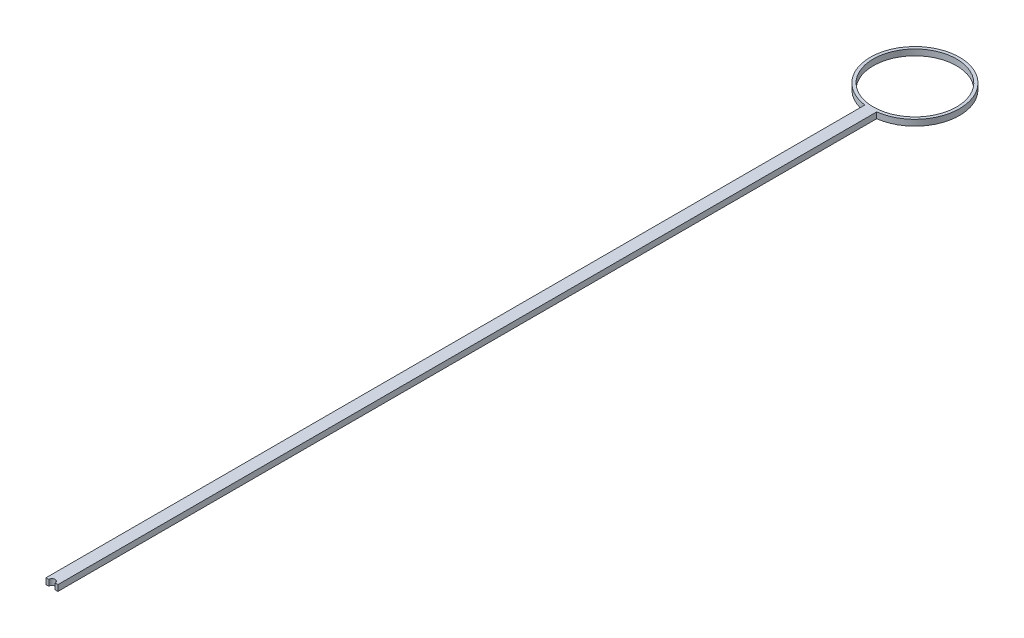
from build123d import *

# Parameters (mm, degrees)
SKIZZE2_R                       = 140
AUFSATZ_LINEAR_AUSTRAGEN1_DEPTH = 20


with BuildPart() as part:
    # Skizze2 → Aufsatz-Linear austragen1 (new body)
    with BuildSketch(Plane(origin=(0, 0, 0), x_dir=(1, 0, 0), z_dir=(0, 1, 0))):
        with BuildLine():
            Line((-20, 2753.639312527), (-20, 0))
            Line((-20, 0), (-10.704852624, 0))
            ThreePointArc((-10.704852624, 0), (0, 10.704852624), (10.704852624, 0))
            Line((10.704852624, 0), (20, 0))
            Line((20, 0), (20, 2753.639312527))
            ThreePointArc((20, 2753.639312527), (0, 3052.3), (-20, 2753.639312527))
        make_face()
        with Locations(Location((0, 2902.3, 0), (0, 0, 270))):
            Circle(SKIZZE2_R, mode=Mode.SUBTRACT)
    extrude(amount=AUFSATZ_LINEAR_AUSTRAGEN1_DEPTH)


solid = part.part
